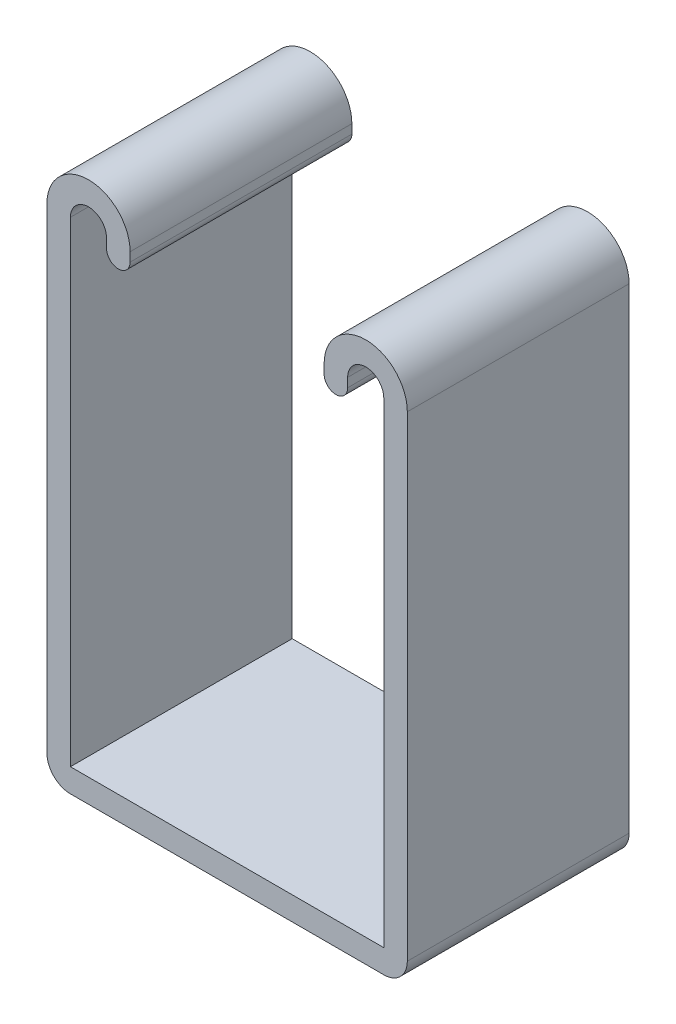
ISO-10303-21;
HEADER;
FILE_DESCRIPTION(('STEP AP214'),'2;1');
FILE_NAME('part.step','',(''),(''),'','','');
FILE_SCHEMA(('AUTOMOTIVE_DESIGN { 1 0 10303 214 1 1 1 1 }'));
ENDSEC;
DATA;
#1=APPLICATION_CONTEXT('core data for automotive mechanical design processes');
#2=APPLICATION_PROTOCOL_DEFINITION('international standard','automotive_design',2000,#1);
#3=PRODUCT_CONTEXT('',#1,'mechanical');
#4=PRODUCT('Part','Part','',(#3));
#5=PRODUCT_RELATED_PRODUCT_CATEGORY('part','',(#4));
#6=PRODUCT_DEFINITION_FORMATION('','',#4);
#7=PRODUCT_DEFINITION_CONTEXT('part definition',#1,'design');
#8=PRODUCT_DEFINITION('design','',#6,#7);
#9=PRODUCT_DEFINITION_SHAPE('','',#8);
#10=(LENGTH_UNIT() NAMED_UNIT(*) SI_UNIT(.MILLI.,.METRE.));
#11=(NAMED_UNIT(*) PLANE_ANGLE_UNIT() SI_UNIT($,.RADIAN.));
#12=(NAMED_UNIT(*) SI_UNIT($,.STERADIAN.) SOLID_ANGLE_UNIT());
#13=UNCERTAINTY_MEASURE_WITH_UNIT(LENGTH_MEASURE(1.E-05),#10,'distance_accuracy_value','');
#14=(GEOMETRIC_REPRESENTATION_CONTEXT(3) GLOBAL_UNCERTAINTY_ASSIGNED_CONTEXT((#13)) GLOBAL_UNIT_ASSIGNED_CONTEXT((#10,
#11,#12)) REPRESENTATION_CONTEXT('',''));
#15=CARTESIAN_POINT('',(0.,0.,0.));
#16=DIRECTION('',(0.,0.,1.));
#17=DIRECTION('',(1.,0.,0.));
#18=AXIS2_PLACEMENT_3D('',#15,#16,#17);
#19=CARTESIAN_POINT('',(-15.875,29.1719,12.7));
#20=DIRECTION('',(0.,0.,-1.));
#21=DIRECTION('',(-1.,0.,0.));
#22=AXIS2_PLACEMENT_3D('',#19,#20,#21);
#23=CYLINDRICAL_SURFACE('',#22,4.7625);
#24=CARTESIAN_POINT('',(-15.875,29.1719,-12.7));
#25=DIRECTION('',(0.,0.,1.));
#26=DIRECTION('',(-1.,0.,0.));
#27=AXIS2_PLACEMENT_3D('',#24,#25,#26);
#28=CIRCLE('',#27,4.7625);
#29=CARTESIAN_POINT('',(-11.1125,29.1719,-12.7));
#30=VERTEX_POINT('',#29);
#31=CARTESIAN_POINT('',(-20.6375,29.1719,-12.7));
#32=VERTEX_POINT('',#31);
#33=EDGE_CURVE('E195',#30,#32,#28,.T.);
#34=ORIENTED_EDGE('',*,*,#33,.T.);
#35=DIRECTION('',(0.,0.,-1.));
#36=VECTOR('',#35,1.);
#37=CARTESIAN_POINT('',(-20.6375,29.1719,12.7));
#38=LINE('',#37,#36);
#39=CARTESIAN_POINT('',(-20.6375,29.1719,12.7));
#40=VERTEX_POINT('',#39);
#41=EDGE_CURVE('E11',#40,#32,#38,.T.);
#42=ORIENTED_EDGE('',*,*,#41,.F.);
#43=CARTESIAN_POINT('',(-15.875,29.1719,12.7));
#44=DIRECTION('',(0.,0.,1.));
#45=DIRECTION('',(-1.,0.,0.));
#46=AXIS2_PLACEMENT_3D('',#43,#44,#45);
#47=CIRCLE('',#46,4.7625);
#48=CARTESIAN_POINT('',(-11.1125,29.1719,12.7));
#49=VERTEX_POINT('',#48);
#50=EDGE_CURVE('E229',#49,#40,#47,.T.);
#51=ORIENTED_EDGE('',*,*,#50,.F.);
#52=DIRECTION('',(0.,0.,-1.));
#53=VECTOR('',#52,1.);
#54=CARTESIAN_POINT('',(-11.1125,29.1719,12.7));
#55=LINE('',#54,#53);
#56=EDGE_CURVE('E191',#49,#30,#55,.T.);
#57=ORIENTED_EDGE('',*,*,#56,.T.);
#58=EDGE_LOOP('',(#34,#42,#51,#57));
#59=FACE_BOUND('',#58,.T.);
#60=ADVANCED_FACE('F39',(#59),#23,.T.);
#61=CARTESIAN_POINT('',(-20.6375,29.1719,12.7));
#62=DIRECTION('',(1.,0.,0.));
#63=DIRECTION('',(0.,1.,0.));
#64=AXIS2_PLACEMENT_3D('',#61,#62,#63);
#65=PLANE('',#64);
#66=DIRECTION('',(0.,-1.,0.));
#67=VECTOR('',#66,1.);
#68=CARTESIAN_POINT('',(-20.6375,29.1719,-12.7));
#69=LINE('',#68,#67);
#70=CARTESIAN_POINT('',(-20.6375,-25.3238,-12.7));
#71=VERTEX_POINT('',#70);
#72=EDGE_CURVE('E198',#32,#71,#69,.T.);
#73=ORIENTED_EDGE('',*,*,#72,.T.);
#74=DIRECTION('',(0.,0.,-1.));
#75=VECTOR('',#74,1.);
#76=CARTESIAN_POINT('',(-20.6375,-25.3238,12.7));
#77=LINE('',#76,#75);
#78=CARTESIAN_POINT('',(-20.6375,-25.3238,12.7));
#79=VERTEX_POINT('',#78);
#80=EDGE_CURVE('E47',#79,#71,#77,.T.);
#81=ORIENTED_EDGE('',*,*,#80,.F.);
#82=DIRECTION('',(0.,-1.,0.));
#83=VECTOR('',#82,1.);
#84=CARTESIAN_POINT('',(-20.6375,29.1719,12.7));
#85=LINE('',#84,#83);
#86=EDGE_CURVE('E128',#40,#79,#85,.T.);
#87=ORIENTED_EDGE('',*,*,#86,.F.);
#88=ORIENTED_EDGE('',*,*,#41,.T.);
#89=EDGE_LOOP('',(#73,#81,#87,#88));
#90=FACE_BOUND('',#89,.T.);
#91=ADVANCED_FACE('F337',(#90),#65,.F.);
#92=CARTESIAN_POINT('',(-17.9451,-25.3238,12.7));
#93=DIRECTION('',(0.,0.,-1.));
#94=DIRECTION('',(-1.,0.,0.));
#95=AXIS2_PLACEMENT_3D('',#92,#93,#94);
#96=CYLINDRICAL_SURFACE('',#95,2.6924);
#97=CARTESIAN_POINT('',(-17.9451,-25.3238,-12.7));
#98=DIRECTION('',(0.,0.,1.));
#99=DIRECTION('',(-1.,0.,0.));
#100=AXIS2_PLACEMENT_3D('',#97,#98,#99);
#101=CIRCLE('',#100,2.6924);
#102=CARTESIAN_POINT('',(-17.9451,-28.0162,-12.7));
#103=VERTEX_POINT('',#102);
#104=EDGE_CURVE('E200',#71,#103,#101,.T.);
#105=ORIENTED_EDGE('',*,*,#104,.T.);
#106=DIRECTION('',(0.,0.,-1.));
#107=VECTOR('',#106,1.);
#108=CARTESIAN_POINT('',(-17.9451,-28.0162,12.7));
#109=LINE('',#108,#107);
#110=CARTESIAN_POINT('',(-17.9451,-28.0162,12.7));
#111=VERTEX_POINT('',#110);
#112=EDGE_CURVE('E266',#111,#103,#109,.T.);
#113=ORIENTED_EDGE('',*,*,#112,.F.);
#114=CARTESIAN_POINT('',(-17.9451,-25.3238,12.7));
#115=DIRECTION('',(0.,0.,1.));
#116=DIRECTION('',(-1.,0.,0.));
#117=AXIS2_PLACEMENT_3D('',#114,#115,#116);
#118=CIRCLE('',#117,2.6924);
#119=EDGE_CURVE('E274',#79,#111,#118,.T.);
#120=ORIENTED_EDGE('',*,*,#119,.F.);
#121=ORIENTED_EDGE('',*,*,#80,.T.);
#122=EDGE_LOOP('',(#105,#113,#120,#121));
#123=FACE_BOUND('',#122,.T.);
#124=ADVANCED_FACE('F272',(#123),#96,.T.);
#125=CARTESIAN_POINT('',(-17.9451,-28.0162,12.7));
#126=DIRECTION('',(0.,1.,0.));
#127=DIRECTION('',(-1.,0.,0.));
#128=AXIS2_PLACEMENT_3D('',#125,#126,#127);
#129=PLANE('',#128);
#130=DIRECTION('',(1.,0.,0.));
#131=VECTOR('',#130,1.);
#132=CARTESIAN_POINT('',(-17.9451,-28.0162,-12.7));
#133=LINE('',#132,#131);
#134=CARTESIAN_POINT('',(17.9451,-28.0162,-12.7));
#135=VERTEX_POINT('',#134);
#136=EDGE_CURVE('E202',#103,#135,#133,.T.);
#137=ORIENTED_EDGE('',*,*,#136,.T.);
#138=DIRECTION('',(0.,0.,-1.));
#139=VECTOR('',#138,1.);
#140=CARTESIAN_POINT('',(17.9451,-28.0162,12.7));
#141=LINE('',#140,#139);
#142=CARTESIAN_POINT('',(17.9451,-28.0162,12.7));
#143=VERTEX_POINT('',#142);
#144=EDGE_CURVE('E263',#143,#135,#141,.T.);
#145=ORIENTED_EDGE('',*,*,#144,.F.);
#146=DIRECTION('',(1.,0.,0.));
#147=VECTOR('',#146,1.);
#148=CARTESIAN_POINT('',(-17.9451,-28.0162,12.7));
#149=LINE('',#148,#147);
#150=EDGE_CURVE('E292',#111,#143,#149,.T.);
#151=ORIENTED_EDGE('',*,*,#150,.F.);
#152=ORIENTED_EDGE('',*,*,#112,.T.);
#153=EDGE_LOOP('',(#137,#145,#151,#152));
#154=FACE_BOUND('',#153,.T.);
#155=ADVANCED_FACE('F283',(#154),#129,.F.);
#156=CARTESIAN_POINT('',(17.9451,-25.3238,12.7));
#157=DIRECTION('',(0.,0.,-1.));
#158=DIRECTION('',(-1.,0.,0.));
#159=AXIS2_PLACEMENT_3D('',#156,#157,#158);
#160=CYLINDRICAL_SURFACE('',#159,2.6924);
#161=CARTESIAN_POINT('',(17.9451,-25.3238,-12.7));
#162=DIRECTION('',(0.,0.,1.));
#163=DIRECTION('',(1.,0.,0.));
#164=AXIS2_PLACEMENT_3D('',#161,#162,#163);
#165=CIRCLE('',#164,2.6924);
#166=CARTESIAN_POINT('',(20.6375,-25.3238,-12.7));
#167=VERTEX_POINT('',#166);
#168=EDGE_CURVE('E204',#135,#167,#165,.T.);
#169=ORIENTED_EDGE('',*,*,#168,.T.);
#170=DIRECTION('',(0.,0.,-1.));
#171=VECTOR('',#170,1.);
#172=CARTESIAN_POINT('',(20.6375,-25.3238,12.7));
#173=LINE('',#172,#171);
#174=CARTESIAN_POINT('',(20.6375,-25.3238,12.7));
#175=VERTEX_POINT('',#174);
#176=EDGE_CURVE('E260',#175,#167,#173,.T.);
#177=ORIENTED_EDGE('',*,*,#176,.F.);
#178=CARTESIAN_POINT('',(17.9451,-25.3238,12.7));
#179=DIRECTION('',(0.,0.,1.));
#180=DIRECTION('',(1.,0.,0.));
#181=AXIS2_PLACEMENT_3D('',#178,#179,#180);
#182=CIRCLE('',#181,2.6924);
#183=EDGE_CURVE('E289',#143,#175,#182,.T.);
#184=ORIENTED_EDGE('',*,*,#183,.F.);
#185=ORIENTED_EDGE('',*,*,#144,.T.);
#186=EDGE_LOOP('',(#169,#177,#184,#185));
#187=FACE_BOUND('',#186,.T.);
#188=ADVANCED_FACE('F287',(#187),#160,.T.);
#189=CARTESIAN_POINT('',(20.6375,-25.3238,12.7));
#190=DIRECTION('',(-1.,0.,0.));
#191=DIRECTION('',(0.,-1.,0.));
#192=AXIS2_PLACEMENT_3D('',#189,#190,#191);
#193=PLANE('',#192);
#194=DIRECTION('',(0.,1.,0.));
#195=VECTOR('',#194,1.);
#196=CARTESIAN_POINT('',(20.6375,-25.3238,-12.7));
#197=LINE('',#196,#195);
#198=CARTESIAN_POINT('',(20.6375,29.1719,-12.7));
#199=VERTEX_POINT('',#198);
#200=EDGE_CURVE('E206',#167,#199,#197,.T.);
#201=ORIENTED_EDGE('',*,*,#200,.T.);
#202=DIRECTION('',(0.,0.,-1.));
#203=VECTOR('',#202,1.);
#204=CARTESIAN_POINT('',(20.6375,29.1719,12.7));
#205=LINE('',#204,#203);
#206=CARTESIAN_POINT('',(20.6375,29.1719,12.7));
#207=VERTEX_POINT('',#206);
#208=EDGE_CURVE('E257',#207,#199,#205,.T.);
#209=ORIENTED_EDGE('',*,*,#208,.F.);
#210=DIRECTION('',(0.,1.,0.));
#211=VECTOR('',#210,1.);
#212=CARTESIAN_POINT('',(20.6375,-25.3238,12.7));
#213=LINE('',#212,#211);
#214=EDGE_CURVE('E291',#175,#207,#213,.T.);
#215=ORIENTED_EDGE('',*,*,#214,.F.);
#216=ORIENTED_EDGE('',*,*,#176,.T.);
#217=EDGE_LOOP('',(#201,#209,#215,#216));
#218=FACE_BOUND('',#217,.T.);
#219=ADVANCED_FACE('F350',(#218),#193,.F.);
#220=CARTESIAN_POINT('',(15.875,29.1719,12.7));
#221=DIRECTION('',(0.,0.,-1.));
#222=DIRECTION('',(-1.,0.,0.));
#223=AXIS2_PLACEMENT_3D('',#220,#221,#222);
#224=CYLINDRICAL_SURFACE('',#223,4.7625);
#225=CARTESIAN_POINT('',(15.875,29.1719,-12.7));
#226=DIRECTION('',(0.,0.,1.));
#227=DIRECTION('',(1.,0.,0.));
#228=AXIS2_PLACEMENT_3D('',#225,#226,#227);
#229=CIRCLE('',#228,4.7625);
#230=CARTESIAN_POINT('',(11.1125,29.1719,-12.7));
#231=VERTEX_POINT('',#230);
#232=EDGE_CURVE('E208',#199,#231,#229,.T.);
#233=ORIENTED_EDGE('',*,*,#232,.T.);
#234=DIRECTION('',(0.,0.,-1.));
#235=VECTOR('',#234,1.);
#236=CARTESIAN_POINT('',(11.1125,29.1719,12.7));
#237=LINE('',#236,#235);
#238=CARTESIAN_POINT('',(11.1125,29.1719,12.7));
#239=VERTEX_POINT('',#238);
#240=EDGE_CURVE('E254',#239,#231,#237,.T.);
#241=ORIENTED_EDGE('',*,*,#240,.F.);
#242=CARTESIAN_POINT('',(15.875,29.1719,12.7));
#243=DIRECTION('',(0.,0.,1.));
#244=DIRECTION('',(1.,0.,0.));
#245=AXIS2_PLACEMENT_3D('',#242,#243,#244);
#246=CIRCLE('',#245,4.7625);
#247=EDGE_CURVE('E294',#207,#239,#246,.T.);
#248=ORIENTED_EDGE('',*,*,#247,.F.);
#249=ORIENTED_EDGE('',*,*,#208,.T.);
#250=EDGE_LOOP('',(#233,#241,#248,#249));
#251=FACE_BOUND('',#250,.T.);
#252=ADVANCED_FACE('F353',(#251),#224,.T.);
#253=CARTESIAN_POINT('',(11.1125,29.1719,12.7));
#254=DIRECTION('',(1.,0.,0.));
#255=DIRECTION('',(0.,1.,0.));
#256=AXIS2_PLACEMENT_3D('',#253,#254,#255);
#257=PLANE('',#256);
#258=DIRECTION('',(0.,-1.,0.));
#259=VECTOR('',#258,1.);
#260=CARTESIAN_POINT('',(11.1125,29.1719,-12.7));
#261=LINE('',#260,#259);
#262=CARTESIAN_POINT('',(11.1125,28.13685,-12.7));
#263=VERTEX_POINT('',#262);
#264=EDGE_CURVE('E210',#231,#263,#261,.T.);
#265=ORIENTED_EDGE('',*,*,#264,.T.);
#266=DIRECTION('',(0.,0.,-1.));
#267=VECTOR('',#266,1.);
#268=CARTESIAN_POINT('',(11.1125,28.13685,12.7));
#269=LINE('',#268,#267);
#270=CARTESIAN_POINT('',(11.1125,28.13685,12.7));
#271=VERTEX_POINT('',#270);
#272=EDGE_CURVE('E251',#271,#263,#269,.T.);
#273=ORIENTED_EDGE('',*,*,#272,.F.);
#274=DIRECTION('',(0.,-1.,0.));
#275=VECTOR('',#274,1.);
#276=CARTESIAN_POINT('',(11.1125,29.1719,12.7));
#277=LINE('',#276,#275);
#278=EDGE_CURVE('E300',#239,#271,#277,.T.);
#279=ORIENTED_EDGE('',*,*,#278,.F.);
#280=ORIENTED_EDGE('',*,*,#240,.T.);
#281=EDGE_LOOP('',(#265,#273,#279,#280));
#282=FACE_BOUND('',#281,.T.);
#283=ADVANCED_FACE('F357',(#282),#257,.F.);
#284=CARTESIAN_POINT('',(12.4587,28.13685,12.7));
#285=DIRECTION('',(0.,0.,-1.));
#286=DIRECTION('',(-1.,0.,0.));
#287=AXIS2_PLACEMENT_3D('',#284,#285,#286);
#288=CYLINDRICAL_SURFACE('',#287,1.3462);
#289=CARTESIAN_POINT('',(12.4587,28.13685,-12.7));
#290=DIRECTION('',(0.,0.,1.));
#291=DIRECTION('',(1.,0.,0.));
#292=AXIS2_PLACEMENT_3D('',#289,#290,#291);
#293=CIRCLE('',#292,1.3462);
#294=CARTESIAN_POINT('',(13.8049,28.13685,-12.7));
#295=VERTEX_POINT('',#294);
#296=EDGE_CURVE('E212',#263,#295,#293,.T.);
#297=ORIENTED_EDGE('',*,*,#296,.T.);
#298=DIRECTION('',(0.,0.,-1.));
#299=VECTOR('',#298,1.);
#300=CARTESIAN_POINT('',(13.8049,28.13685,12.7));
#301=LINE('',#300,#299);
#302=CARTESIAN_POINT('',(13.8049,28.13685,12.7));
#303=VERTEX_POINT('',#302);
#304=EDGE_CURVE('E248',#303,#295,#301,.T.);
#305=ORIENTED_EDGE('',*,*,#304,.F.);
#306=CARTESIAN_POINT('',(12.4587,28.13685,12.7));
#307=DIRECTION('',(0.,0.,1.));
#308=DIRECTION('',(1.,0.,0.));
#309=AXIS2_PLACEMENT_3D('',#306,#307,#308);
#310=CIRCLE('',#309,1.3462);
#311=EDGE_CURVE('E302',#271,#303,#310,.T.);
#312=ORIENTED_EDGE('',*,*,#311,.F.);
#313=ORIENTED_EDGE('',*,*,#272,.T.);
#314=EDGE_LOOP('',(#297,#305,#312,#313));
#315=FACE_BOUND('',#314,.T.);
#316=ADVANCED_FACE('F361',(#315),#288,.T.);
#317=CARTESIAN_POINT('',(13.8049,29.1719,12.7));
#318=DIRECTION('',(-1.,0.,0.));
#319=DIRECTION('',(0.,0.,1.));
#320=AXIS2_PLACEMENT_3D('',#317,#318,#319);
#321=PLANE('',#320);
#322=DIRECTION('',(0.,1.,0.));
#323=VECTOR('',#322,1.);
#324=CARTESIAN_POINT('',(13.8049,29.1719,-12.7));
#325=LINE('',#324,#323);
#326=CARTESIAN_POINT('',(13.8049,29.1719,-12.7));
#327=VERTEX_POINT('',#326);
#328=EDGE_CURVE('E214',#295,#327,#325,.T.);
#329=ORIENTED_EDGE('',*,*,#328,.T.);
#330=DIRECTION('',(0.,0.,-1.));
#331=VECTOR('',#330,1.);
#332=CARTESIAN_POINT('',(13.8049,29.1719,12.7));
#333=LINE('',#332,#331);
#334=CARTESIAN_POINT('',(13.8049,29.1719,12.7));
#335=VERTEX_POINT('',#334);
#336=EDGE_CURVE('E245',#335,#327,#333,.T.);
#337=ORIENTED_EDGE('',*,*,#336,.F.);
#338=DIRECTION('',(0.,1.,0.));
#339=VECTOR('',#338,1.);
#340=CARTESIAN_POINT('',(13.8049,29.1719,12.7));
#341=LINE('',#340,#339);
#342=EDGE_CURVE('E304',#303,#335,#341,.T.);
#343=ORIENTED_EDGE('',*,*,#342,.F.);
#344=ORIENTED_EDGE('',*,*,#304,.T.);
#345=EDGE_LOOP('',(#329,#337,#343,#344));
#346=FACE_BOUND('',#345,.T.);
#347=ADVANCED_FACE('F365',(#346),#321,.F.);
#348=CARTESIAN_POINT('',(15.875,29.1719,12.7));
#349=DIRECTION('',(0.,0.,-1.));
#350=DIRECTION('',(-1.,0.,0.));
#351=AXIS2_PLACEMENT_3D('',#348,#349,#350);
#352=CYLINDRICAL_SURFACE('',#351,2.0701);
#353=CARTESIAN_POINT('',(15.875,29.1719,-12.7));
#354=DIRECTION('',(0.,0.,-1.));
#355=DIRECTION('',(1.,0.,0.));
#356=AXIS2_PLACEMENT_3D('',#353,#354,#355);
#357=CIRCLE('',#356,2.0701);
#358=CARTESIAN_POINT('',(17.9451,29.1719,-12.7));
#359=VERTEX_POINT('',#358);
#360=EDGE_CURVE('E216',#327,#359,#357,.T.);
#361=ORIENTED_EDGE('',*,*,#360,.T.);
#362=DIRECTION('',(0.,0.,-1.));
#363=VECTOR('',#362,1.);
#364=CARTESIAN_POINT('',(17.9451,29.1719,12.7));
#365=LINE('',#364,#363);
#366=CARTESIAN_POINT('',(17.9451,29.1719,12.7));
#367=VERTEX_POINT('',#366);
#368=EDGE_CURVE('E242',#367,#359,#365,.T.);
#369=ORIENTED_EDGE('',*,*,#368,.F.);
#370=CARTESIAN_POINT('',(15.875,29.1719,12.7));
#371=DIRECTION('',(0.,0.,-1.));
#372=DIRECTION('',(1.,0.,0.));
#373=AXIS2_PLACEMENT_3D('',#370,#371,#372);
#374=CIRCLE('',#373,2.0701);
#375=EDGE_CURVE('E306',#335,#367,#374,.T.);
#376=ORIENTED_EDGE('',*,*,#375,.F.);
#377=ORIENTED_EDGE('',*,*,#336,.T.);
#378=EDGE_LOOP('',(#361,#369,#376,#377));
#379=FACE_BOUND('',#378,.T.);
#380=ADVANCED_FACE('F369',(#379),#352,.F.);
#381=CARTESIAN_POINT('',(17.9451,-25.3238,12.7));
#382=DIRECTION('',(1.,0.,0.));
#383=DIRECTION('',(0.,0.,-1.));
#384=AXIS2_PLACEMENT_3D('',#381,#382,#383);
#385=PLANE('',#384);
#386=DIRECTION('',(0.,-1.,0.));
#387=VECTOR('',#386,1.);
#388=CARTESIAN_POINT('',(17.9451,-25.3238,-12.7));
#389=LINE('',#388,#387);
#390=CARTESIAN_POINT('',(17.9451,-25.3238,-12.7));
#391=VERTEX_POINT('',#390);
#392=EDGE_CURVE('E218',#359,#391,#389,.T.);
#393=ORIENTED_EDGE('',*,*,#392,.T.);
#394=DIRECTION('',(0.,0.,-1.));
#395=VECTOR('',#394,1.);
#396=CARTESIAN_POINT('',(17.9451,-25.3238,12.7));
#397=LINE('',#396,#395);
#398=CARTESIAN_POINT('',(17.9451,-25.3238,12.7));
#399=VERTEX_POINT('',#398);
#400=EDGE_CURVE('E239',#399,#391,#397,.T.);
#401=ORIENTED_EDGE('',*,*,#400,.F.);
#402=DIRECTION('',(0.,-1.,0.));
#403=VECTOR('',#402,1.);
#404=CARTESIAN_POINT('',(17.9451,-25.3238,12.7));
#405=LINE('',#404,#403);
#406=EDGE_CURVE('E308',#367,#399,#405,.T.);
#407=ORIENTED_EDGE('',*,*,#406,.F.);
#408=ORIENTED_EDGE('',*,*,#368,.T.);
#409=EDGE_LOOP('',(#393,#401,#407,#408));
#410=FACE_BOUND('',#409,.T.);
#411=ADVANCED_FACE('F373',(#410),#385,.F.);
#412=CARTESIAN_POINT('',(-17.9451,-25.3238,12.7));
#413=DIRECTION('',(0.,-1.,0.));
#414=DIRECTION('',(0.,0.,-1.));
#415=AXIS2_PLACEMENT_3D('',#412,#413,#414);
#416=PLANE('',#415);
#417=DIRECTION('',(-1.,0.,0.));
#418=VECTOR('',#417,1.);
#419=CARTESIAN_POINT('',(-17.9451,-25.3238,-12.7));
#420=LINE('',#419,#418);
#421=CARTESIAN_POINT('',(-17.9451,-25.3238,-12.7));
#422=VERTEX_POINT('',#421);
#423=EDGE_CURVE('E220',#391,#422,#420,.T.);
#424=ORIENTED_EDGE('',*,*,#423,.T.);
#425=DIRECTION('',(0.,0.,-1.));
#426=VECTOR('',#425,1.);
#427=CARTESIAN_POINT('',(-17.9451,-25.3238,12.7));
#428=LINE('',#427,#426);
#429=CARTESIAN_POINT('',(-17.9451,-25.3238,12.7));
#430=VERTEX_POINT('',#429);
#431=EDGE_CURVE('E236',#430,#422,#428,.T.);
#432=ORIENTED_EDGE('',*,*,#431,.F.);
#433=DIRECTION('',(-1.,0.,0.));
#434=VECTOR('',#433,1.);
#435=CARTESIAN_POINT('',(-17.9451,-25.3238,12.7));
#436=LINE('',#435,#434);
#437=EDGE_CURVE('E310',#399,#430,#436,.T.);
#438=ORIENTED_EDGE('',*,*,#437,.F.);
#439=ORIENTED_EDGE('',*,*,#400,.T.);
#440=EDGE_LOOP('',(#424,#432,#438,#439));
#441=FACE_BOUND('',#440,.T.);
#442=ADVANCED_FACE('F377',(#441),#416,.F.);
#443=CARTESIAN_POINT('',(-17.9451,29.1719,12.7));
#444=DIRECTION('',(-1.,0.,0.));
#445=DIRECTION('',(0.,-1.,0.));
#446=AXIS2_PLACEMENT_3D('',#443,#444,#445);
#447=PLANE('',#446);
#448=DIRECTION('',(0.,1.,0.));
#449=VECTOR('',#448,1.);
#450=CARTESIAN_POINT('',(-17.9451,29.1719,-12.7));
#451=LINE('',#450,#449);
#452=CARTESIAN_POINT('',(-17.9451,29.1719,-12.7));
#453=VERTEX_POINT('',#452);
#454=EDGE_CURVE('E222',#422,#453,#451,.T.);
#455=ORIENTED_EDGE('',*,*,#454,.T.);
#456=DIRECTION('',(0.,0.,-1.));
#457=VECTOR('',#456,1.);
#458=CARTESIAN_POINT('',(-17.9451,29.1719,12.7));
#459=LINE('',#458,#457);
#460=CARTESIAN_POINT('',(-17.9451,29.1719,12.7));
#461=VERTEX_POINT('',#460);
#462=EDGE_CURVE('E233',#461,#453,#459,.T.);
#463=ORIENTED_EDGE('',*,*,#462,.F.);
#464=DIRECTION('',(0.,1.,0.));
#465=VECTOR('',#464,1.);
#466=CARTESIAN_POINT('',(-17.9451,29.1719,12.7));
#467=LINE('',#466,#465);
#468=EDGE_CURVE('E312',#430,#461,#467,.T.);
#469=ORIENTED_EDGE('',*,*,#468,.F.);
#470=ORIENTED_EDGE('',*,*,#431,.T.);
#471=EDGE_LOOP('',(#455,#463,#469,#470));
#472=FACE_BOUND('',#471,.T.);
#473=ADVANCED_FACE('F318',(#472),#447,.F.);
#474=CARTESIAN_POINT('',(-15.875,29.1719,12.7));
#475=DIRECTION('',(0.,0.,-1.));
#476=DIRECTION('',(-1.,0.,0.));
#477=AXIS2_PLACEMENT_3D('',#474,#475,#476);
#478=CYLINDRICAL_SURFACE('',#477,2.0701);
#479=CARTESIAN_POINT('',(-15.875,29.1719,-12.7));
#480=DIRECTION('',(0.,0.,-1.));
#481=DIRECTION('',(-1.,0.,0.));
#482=AXIS2_PLACEMENT_3D('',#479,#480,#481);
#483=CIRCLE('',#482,2.0701);
#484=CARTESIAN_POINT('',(-13.8049,29.1719,-12.7));
#485=VERTEX_POINT('',#484);
#486=EDGE_CURVE('E224',#453,#485,#483,.T.);
#487=ORIENTED_EDGE('',*,*,#486,.T.);
#488=DIRECTION('',(0.,0.,-1.));
#489=VECTOR('',#488,1.);
#490=CARTESIAN_POINT('',(-13.8049,29.1719,12.7));
#491=LINE('',#490,#489);
#492=CARTESIAN_POINT('',(-13.8049,29.1719,12.7));
#493=VERTEX_POINT('',#492);
#494=EDGE_CURVE('E186',#493,#485,#491,.T.);
#495=ORIENTED_EDGE('',*,*,#494,.F.);
#496=CARTESIAN_POINT('',(-15.875,29.1719,12.7));
#497=DIRECTION('',(0.,0.,-1.));
#498=DIRECTION('',(-1.,0.,0.));
#499=AXIS2_PLACEMENT_3D('',#496,#497,#498);
#500=CIRCLE('',#499,2.0701);
#501=EDGE_CURVE('E177',#461,#493,#500,.T.);
#502=ORIENTED_EDGE('',*,*,#501,.F.);
#503=ORIENTED_EDGE('',*,*,#462,.T.);
#504=EDGE_LOOP('',(#487,#495,#502,#503));
#505=FACE_BOUND('',#504,.T.);
#506=ADVANCED_FACE('F322',(#505),#478,.F.);
#507=CARTESIAN_POINT('',(-13.8049,29.1719,12.7));
#508=DIRECTION('',(1.,0.,0.));
#509=DIRECTION('',(0.,0.,-1.));
#510=AXIS2_PLACEMENT_3D('',#507,#508,#509);
#511=PLANE('',#510);
#512=DIRECTION('',(0.,-1.,0.));
#513=VECTOR('',#512,1.);
#514=CARTESIAN_POINT('',(-13.8049,29.1719,-12.7));
#515=LINE('',#514,#513);
#516=CARTESIAN_POINT('',(-13.8049,28.13685,-12.7));
#517=VERTEX_POINT('',#516);
#518=EDGE_CURVE('E185',#485,#517,#515,.T.);
#519=ORIENTED_EDGE('',*,*,#518,.T.);
#520=DIRECTION('',(0.,0.,-1.));
#521=VECTOR('',#520,1.);
#522=CARTESIAN_POINT('',(-13.8049,28.13685,12.7));
#523=LINE('',#522,#521);
#524=CARTESIAN_POINT('',(-13.8049,28.13685,12.7));
#525=VERTEX_POINT('',#524);
#526=EDGE_CURVE('E182',#525,#517,#523,.T.);
#527=ORIENTED_EDGE('',*,*,#526,.F.);
#528=DIRECTION('',(0.,-1.,0.));
#529=VECTOR('',#528,1.);
#530=CARTESIAN_POINT('',(-13.8049,29.1719,12.7));
#531=LINE('',#530,#529);
#532=EDGE_CURVE('E171',#493,#525,#531,.T.);
#533=ORIENTED_EDGE('',*,*,#532,.F.);
#534=ORIENTED_EDGE('',*,*,#494,.T.);
#535=EDGE_LOOP('',(#519,#527,#533,#534));
#536=FACE_BOUND('',#535,.T.);
#537=ADVANCED_FACE('F183',(#536),#511,.F.);
#538=CARTESIAN_POINT('',(-12.4587,28.13685,12.7));
#539=DIRECTION('',(0.,0.,-1.));
#540=DIRECTION('',(-1.,0.,0.));
#541=AXIS2_PLACEMENT_3D('',#538,#539,#540);
#542=CYLINDRICAL_SURFACE('',#541,1.3462);
#543=CARTESIAN_POINT('',(-12.4587,28.13685,-12.7));
#544=DIRECTION('',(0.,0.,1.));
#545=DIRECTION('',(-1.,0.,0.));
#546=AXIS2_PLACEMENT_3D('',#543,#544,#545);
#547=CIRCLE('',#546,1.3462);
#548=CARTESIAN_POINT('',(-11.1125,28.13685,-12.7));
#549=VERTEX_POINT('',#548);
#550=EDGE_CURVE('E114',#517,#549,#547,.T.);
#551=ORIENTED_EDGE('',*,*,#550,.T.);
#552=DIRECTION('',(0.,0.,-1.));
#553=VECTOR('',#552,1.);
#554=CARTESIAN_POINT('',(-11.1125,28.13685,12.7));
#555=LINE('',#554,#553);
#556=CARTESIAN_POINT('',(-11.1125,28.13685,12.7));
#557=VERTEX_POINT('',#556);
#558=EDGE_CURVE('E187',#557,#549,#555,.T.);
#559=ORIENTED_EDGE('',*,*,#558,.F.);
#560=CARTESIAN_POINT('',(-12.4587,28.13685,12.7));
#561=DIRECTION('',(0.,0.,1.));
#562=DIRECTION('',(-1.,0.,0.));
#563=AXIS2_PLACEMENT_3D('',#560,#561,#562);
#564=CIRCLE('',#563,1.3462);
#565=EDGE_CURVE('E175',#525,#557,#564,.T.);
#566=ORIENTED_EDGE('',*,*,#565,.F.);
#567=ORIENTED_EDGE('',*,*,#526,.T.);
#568=EDGE_LOOP('',(#551,#559,#566,#567));
#569=FACE_BOUND('',#568,.T.);
#570=ADVANCED_FACE('F189',(#569),#542,.T.);
#571=CARTESIAN_POINT('',(-11.1125,29.1719,12.7));
#572=DIRECTION('',(-1.,0.,0.));
#573=DIRECTION('',(0.,-1.,0.));
#574=AXIS2_PLACEMENT_3D('',#571,#572,#573);
#575=PLANE('',#574);
#576=DIRECTION('',(0.,1.,0.));
#577=VECTOR('',#576,1.);
#578=CARTESIAN_POINT('',(-11.1125,29.1719,-12.7));
#579=LINE('',#578,#577);
#580=EDGE_CURVE('E120',#549,#30,#579,.T.);
#581=ORIENTED_EDGE('',*,*,#580,.T.);
#582=ORIENTED_EDGE('',*,*,#56,.F.);
#583=DIRECTION('',(0.,1.,0.));
#584=VECTOR('',#583,1.);
#585=CARTESIAN_POINT('',(-11.1125,29.1719,12.7));
#586=LINE('',#585,#584);
#587=EDGE_CURVE('E55',#557,#49,#586,.T.);
#588=ORIENTED_EDGE('',*,*,#587,.F.);
#589=ORIENTED_EDGE('',*,*,#558,.T.);
#590=EDGE_LOOP('',(#581,#582,#588,#589));
#591=FACE_BOUND('',#590,.T.);
#592=ADVANCED_FACE('F326',(#591),#575,.F.);
#593=CARTESIAN_POINT('',(-15.875,29.1719,12.7));
#594=DIRECTION('',(0.,0.,-1.));
#595=DIRECTION('',(-1.,0.,0.));
#596=AXIS2_PLACEMENT_3D('',#593,#594,#595);
#597=PLANE('',#596);
#598=ORIENTED_EDGE('',*,*,#50,.T.);
#599=ORIENTED_EDGE('',*,*,#86,.T.);
#600=ORIENTED_EDGE('',*,*,#119,.T.);
#601=ORIENTED_EDGE('',*,*,#150,.T.);
#602=ORIENTED_EDGE('',*,*,#183,.T.);
#603=ORIENTED_EDGE('',*,*,#214,.T.);
#604=ORIENTED_EDGE('',*,*,#247,.T.);
#605=ORIENTED_EDGE('',*,*,#278,.T.);
#606=ORIENTED_EDGE('',*,*,#311,.T.);
#607=ORIENTED_EDGE('',*,*,#342,.T.);
#608=ORIENTED_EDGE('',*,*,#375,.T.);
#609=ORIENTED_EDGE('',*,*,#406,.T.);
#610=ORIENTED_EDGE('',*,*,#437,.T.);
#611=ORIENTED_EDGE('',*,*,#468,.T.);
#612=ORIENTED_EDGE('',*,*,#501,.T.);
#613=ORIENTED_EDGE('',*,*,#532,.T.);
#614=ORIENTED_EDGE('',*,*,#565,.T.);
#615=ORIENTED_EDGE('',*,*,#587,.T.);
#616=EDGE_LOOP('',(#598,#599,#600,#601,#602,#603,#604,#605,#606,#607,#608,#609,#610,#611,#612,
#613,#614,#615));
#617=FACE_BOUND('',#616,.T.);
#618=ADVANCED_FACE('F173',(#617),#597,.F.);
#619=CARTESIAN_POINT('',(-15.875,29.1719,-12.7));
#620=DIRECTION('',(0.,0.,-1.));
#621=DIRECTION('',(-1.,0.,0.));
#622=AXIS2_PLACEMENT_3D('',#619,#620,#621);
#623=PLANE('',#622);
#624=ORIENTED_EDGE('',*,*,#33,.F.);
#625=ORIENTED_EDGE('',*,*,#580,.F.);
#626=ORIENTED_EDGE('',*,*,#550,.F.);
#627=ORIENTED_EDGE('',*,*,#518,.F.);
#628=ORIENTED_EDGE('',*,*,#486,.F.);
#629=ORIENTED_EDGE('',*,*,#454,.F.);
#630=ORIENTED_EDGE('',*,*,#423,.F.);
#631=ORIENTED_EDGE('',*,*,#392,.F.);
#632=ORIENTED_EDGE('',*,*,#360,.F.);
#633=ORIENTED_EDGE('',*,*,#328,.F.);
#634=ORIENTED_EDGE('',*,*,#296,.F.);
#635=ORIENTED_EDGE('',*,*,#264,.F.);
#636=ORIENTED_EDGE('',*,*,#232,.F.);
#637=ORIENTED_EDGE('',*,*,#200,.F.);
#638=ORIENTED_EDGE('',*,*,#168,.F.);
#639=ORIENTED_EDGE('',*,*,#136,.F.);
#640=ORIENTED_EDGE('',*,*,#104,.F.);
#641=ORIENTED_EDGE('',*,*,#72,.F.);
#642=EDGE_LOOP('',(#624,#625,#626,#627,#628,#629,#630,#631,#632,#633,#634,#635,#636,#637,#638,
#639,#640,#641));
#643=FACE_BOUND('',#642,.T.);
#644=ADVANCED_FACE('F278',(#643),#623,.T.);
#645=CLOSED_SHELL('',(#60,#91,#124,#155,#188,#219,#252,#283,#316,#347,#380,#411,#442,#473,#506,
#537,#570,#592,#618,#644));
#646=MANIFOLD_SOLID_BREP('B2',#645);
#647=ADVANCED_BREP_SHAPE_REPRESENTATION('',(#18,#646),#14);
#648=SHAPE_DEFINITION_REPRESENTATION(#9,#647);
ENDSEC;
END-ISO-10303-21;
